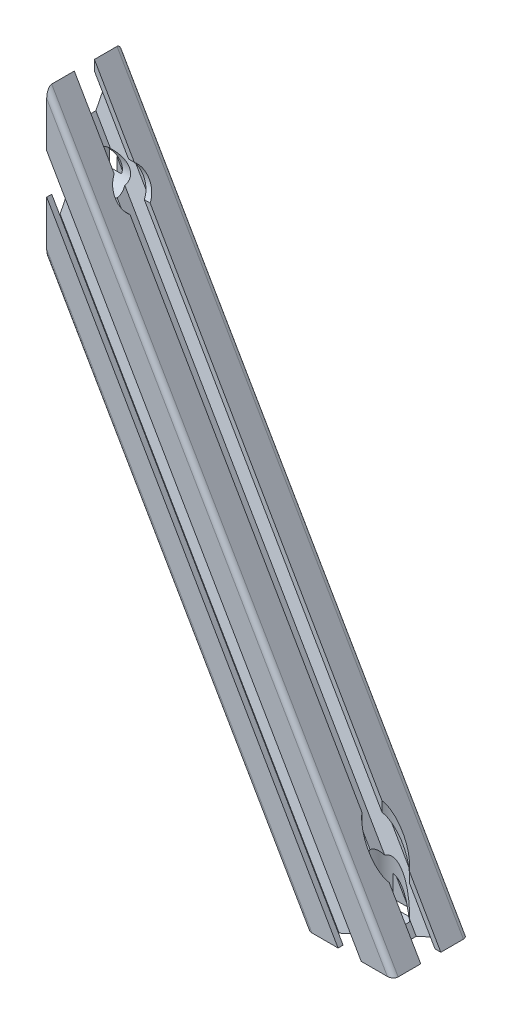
from build123d import *

# Parameters (mm, degrees)
SKETCH2_R                          = 3.4
SKETCH2_R_2                        = 2.1
BOSS_EXTRUDE1_DEPTH                = 276
CUT_EXTRUDE1_DEPTH                 = 277.407308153
CUT_EXTRUDE1_DEPTH_BACK            = 277.407308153
SKETCH3_OUTSIDE_W                  = 226.749
SKETCH3_OUTSIDE_H                  = 316.791
SOCKET_HEAD_CAP_SCREW1_D           = 6.5
SOCKET_HEAD_CAP_SCREW1_CBORE_D     = 13.5
SOCKET_HEAD_CAP_SCREW1_CBORE_DEPTH = 96
SOCKET_HEAD_CAP_SCREW2_D           = 6.5
SOCKET_HEAD_CAP_SCREW2_CBORE_D     = 13.5
SOCKET_HEAD_CAP_SCREW2_CBORE_DEPTH = 96


with BuildPart() as part:
    # Sketch2 → Boss-Extrude1 (new body)
    with BuildSketch(Plane(origin=(0, 239.023011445, 0), x_dir=(-0.8660254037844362, -0.5000000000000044, 0), z_dir=(0.5000000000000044, -0.8660254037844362, 0))):
        with BuildLine():
            Line((24.664213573, 8.25), (28.000000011, 8.25))
            Line((28.000000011, 8.25), (28.000000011, 4))
            Line((28.000000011, 4), (29.999999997, 4))
            Line((29.999999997, 4), (29.999999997, 13.000000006))
            ThreePointArc((29.999999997, 13.000000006), (29.414213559, 14.414213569), (27.999999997, 15.000000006))
            Line((27.999999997, 15.000000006), (18.999999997, 15.000000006))
            Line((18.999999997, 15.000000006), (18.999999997, 13.000000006))
            Line((18.999999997, 13.000000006), (23.249999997, 13.000000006))
            Line((23.249999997, 13.000000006), (23.249999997, 9.664213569))
            Line((23.249999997, 9.664213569), (19.585786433, 6.000000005))
            Line((19.585786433, 6.000000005), (15.519615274, 6.000000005))
            Line((15.519615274, 6.000000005), (14.999999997, 5.699999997))
            Line((14.999999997, 5.699999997), (14.480384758, 5.999999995))
            Line((14.480384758, 5.999999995), (10.414213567, 5.999999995))
            Line((10.414213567, 5.999999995), (6.75, 9.664213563))
            Line((6.75, 9.664213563), (6.75, 13))
            Line((6.75, 13), (11, 13))
            Line((11, 13), (11, 15))
            Line((11, 15), (2, 15))
            ThreePointArc((2, 15), (0.585786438, 14.414213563), (0, 13))
            Line((0, 13), (0, 4))
            Line((0, 4), (2, 4))
            Line((2, 4), (2, 8.25))
            Line((2, 8.25), (5.335786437, 8.25))
            Line((5.335786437, 8.25), (8.999999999, 4.585786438))
            Line((8.999999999, 4.585786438), (8.999999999, 0.519615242))
            Line((8.999999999, 0.519615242), (9.3, -1e-09))
            Line((9.3, -1e-09), (9, -0.519615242))
            Line((9, -0.519615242), (9, -4.585786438))
            Line((9, -4.585786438), (5.335786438, -8.25))
            Line((5.335786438, -8.25), (2, -8.25))
            Line((2, -8.25), (2, -4))
            Line((2, -4), (0, -4))
            Line((0, -4), (0, -13))
            ThreePointArc((0, -13), (0.585786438, -14.414213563), (2, -15))
            Line((2, -15), (11, -15))
            Line((11, -15), (11, -13))
            Line((11, -13), (6.75, -13))
            Line((6.75, -13), (6.75, -9.664213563))
            Line((6.75, -9.664213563), (10.414213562, -6))
            Line((10.414213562, -6), (14.480384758, -6))
            Line((14.480384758, -6), (15, -5.7))
            Line((15, -5.7), (15.519615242, -6))
            Line((15.519615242, -6), (19.585786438, -6))
            Line((19.585786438, -6), (23.25, -9.664213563))
            Line((23.25, -9.664213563), (23.25, -13))
            Line((23.25, -13), (19, -13))
            Line((19, -13), (19, -15))
            Line((19, -15), (28, -15))
            ThreePointArc((28, -15), (29.414213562, -14.414213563), (30, -13))
            Line((30, -13), (30, -4))
            Line((30, -4), (28, -4))
            Line((28, -4), (28, -8.25))
            Line((28, -8.25), (24.664213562, -8.25))
            Line((24.664213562, -8.25), (21, -4.585786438))
            Line((21, -4.585786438), (21, -0.519615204))
            Line((21, -0.519615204), (20.699999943, 9.8e-08))
            Line((20.699999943, 9.8e-08), (21.000000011, 0.519615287))
            Line((21.000000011, 0.519615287), (21.000000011, 4.585786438))
            Line((21.000000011, 4.585786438), (24.664213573, 8.25))
        make_face()
        with Locations(Location((15, 0, 0), (0, 0, 180))):
            Circle(SKETCH2_R, mode=Mode.SUBTRACT)
        with Locations(Location((3.4, -11.6, 0), (0, 0, 180))):
            Circle(SKETCH2_R_2, mode=Mode.SUBTRACT)
        with Locations(Location((26.6, -11.6, 0), (0, 0, 180))):
            Circle(SKETCH2_R_2, mode=Mode.SUBTRACT)
        with Locations(Location((3.4, 11.6, 0), (0, 0, 180))):
            Circle(SKETCH2_R_2, mode=Mode.SUBTRACT)
        with Locations(Location((26.6, 11.6, 0), (0, 0, 180))):
            Circle(SKETCH2_R_2, mode=Mode.SUBTRACT)
    extrude(amount=BOSS_EXTRUDE1_DEPTH)

    # Sketch3 outside → Cut-Extrude1 (cut, two sides: drawn at the far end of the back side and taken through both)
    with BuildSketch(Plane.XY.offset(-CUT_EXTRUDE1_DEPTH_BACK)):
        with Locations((56.0095, 112.0115)):
            Rectangle(SKETCH3_OUTSIDE_W, SKETCH3_OUTSIDE_H)
        Polygon((0, 239.023011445), (138, 0), (0, 0), align=None, mode=Mode.SUBTRACT)
    extrude(amount=CUT_EXTRUDE1_DEPTH + CUT_EXTRUDE1_DEPTH_BACK, mode=Mode.SUBTRACT)

    # Socket Head Cap Screw1 (through all)
    with Locations(Plane(origin=(0, 100, 0), x_dir=(1, 0, 0), z_dir=(0, 1, 0))):
        with Locations((120, 0)):
            CounterBoreHole(SOCKET_HEAD_CAP_SCREW1_D / 2, SOCKET_HEAD_CAP_SCREW1_CBORE_D / 2, SOCKET_HEAD_CAP_SCREW1_CBORE_DEPTH)

    # Socket Head Cap Screw2 (through all)
    with Locations(Plane(origin=(100, 0, 0), x_dir=(0, 0, -1), z_dir=(1, 0, 0))):
        with Locations((0, 206.023011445)):
            CounterBoreHole(SOCKET_HEAD_CAP_SCREW2_D / 2, SOCKET_HEAD_CAP_SCREW2_CBORE_D / 2, SOCKET_HEAD_CAP_SCREW2_CBORE_DEPTH)


solid = part.part
